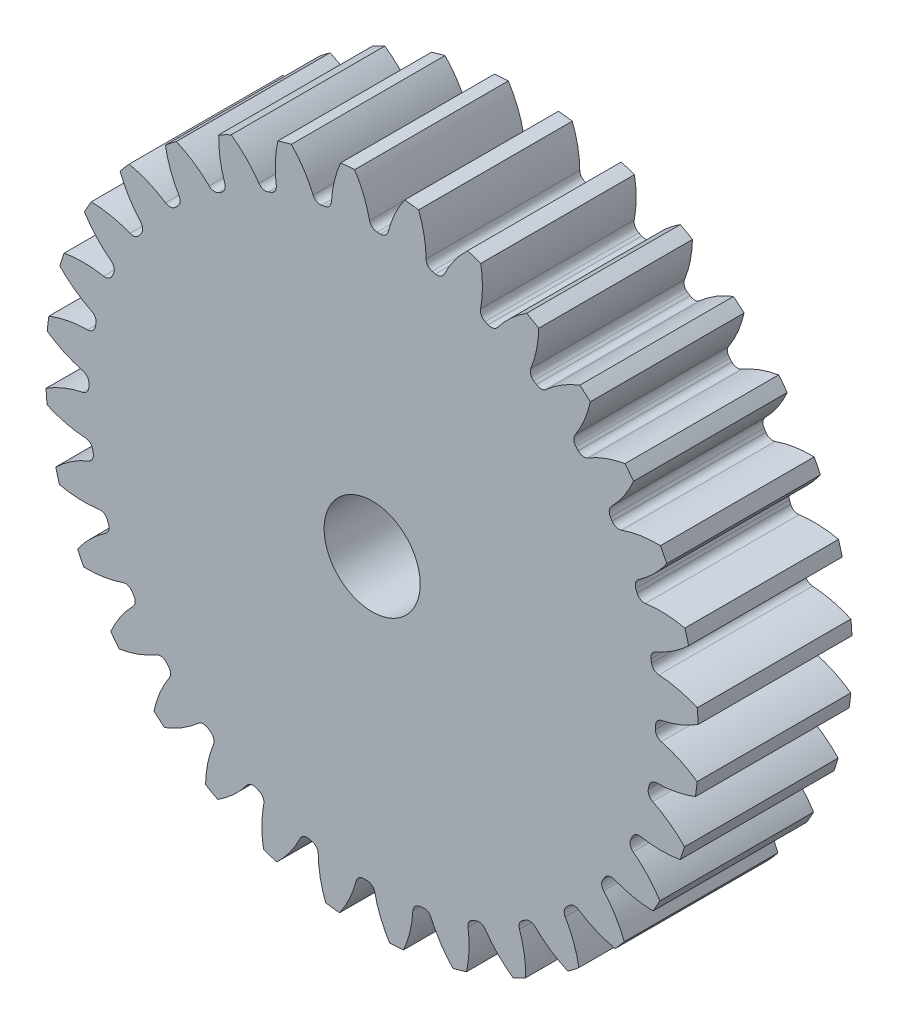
from build123d import *

# Parameters (mm, degrees)
SKETCH3_R         = 215.9
GEARBODY_DEPTH    = 101.6
TOOTHCUT_DEPTH    = 322.789030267
CIRPATTERN1_COUNT = 32
BOREDIA_R         = 31.75
BORE_DEPTH        = 12700


with BuildPart() as part:
    # Sketch3 → gearBody (new body)
    with BuildSketch(Plane.XY):
        Circle(SKETCH3_R)
    extrude(amount=GEARBODY_DEPTH)

    # Sketch2 → toothCut (cut, through all)
    with BuildSketch(Plane.XY):
        with BuildLine():
            ThreePointArc((187.246609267, -5.418758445), (187.274917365, -4.33139136), (187.296911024, -3.243878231))
            ThreePointArc((187.296911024, -3.243878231), (188.480196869, -0.041186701), (191.402148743, 1.725051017))
            ThreePointArc((191.402148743, 1.725051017), (204.111857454, 5.634817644), (215.9, 11.788082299))
            ThreePointArc((215.9, 11.788082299), (216.163765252, -4.999547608), (215.124151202, -21.757032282))
            ThreePointArc((215.124151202, -21.757032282), (203.63309315, -15.06535421), (191.117732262, -10.572169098))
            ThreePointArc((191.117732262, -10.572169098), (188.280562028, -8.672731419), (187.246609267, -5.418758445))
        make_face()
    toothcut = extrude(amount=TOOTHCUT_DEPTH, mode=Mode.SUBTRACT)

    # CirPattern1: toothCut ×32 about axis
    cirpattern1_axis = Axis((0, 0, 0), (0, 0, 1))
    for i in range(1, CIRPATTERN1_COUNT):
        add(toothcut.rotate(cirpattern1_axis, i * 360 / CIRPATTERN1_COUNT), mode=Mode.SUBTRACT)

    # boreDia → bore (cut, symmetric)
    with BuildSketch(Plane.XY):
        Circle(BOREDIA_R)
    extrude(amount=BORE_DEPTH, both=True, mode=Mode.SUBTRACT)


solid = part.part
